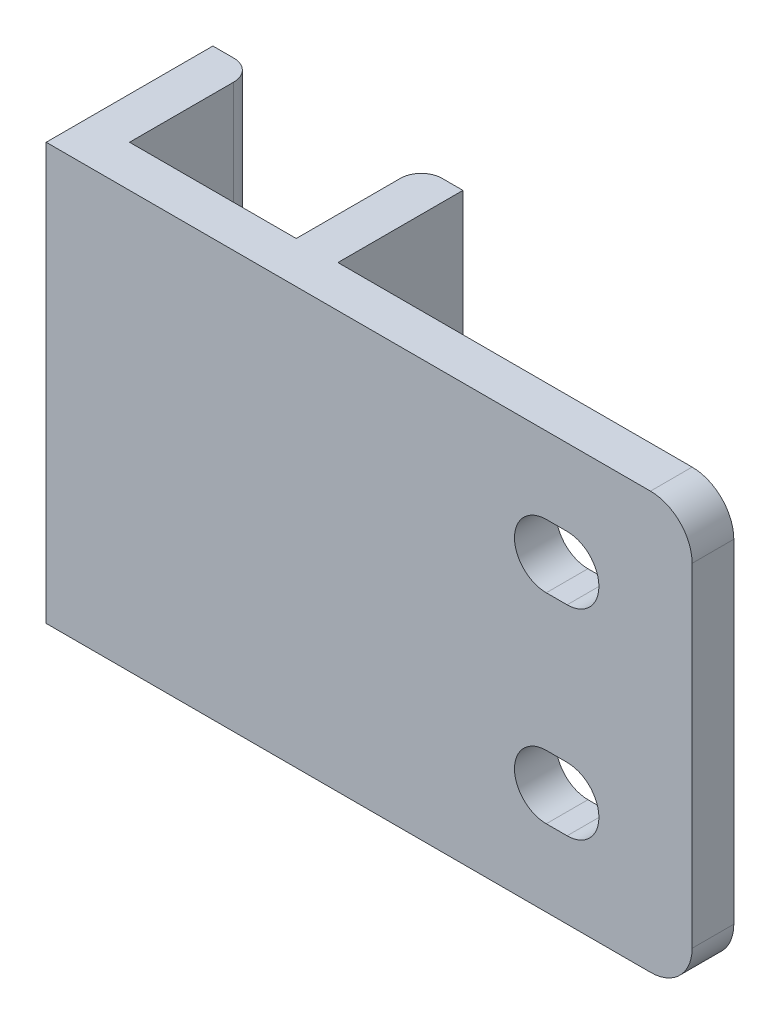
from build123d import *

# Parameters (mm, degrees)
ESQUISSE1_W        = 31
ESQUISSE1_H        = 20
BOSS_EXTRU_1_DEPTH = 2
ESQUISSE3_W        = 2
ESQUISSE3_H        = 20
BOSS_EXTRU_2_DEPTH = 6
CONG_1_R           = 1
CONG_2_R           = 2


with BuildPart() as part:
    # Esquisse1 → Boss.-Extru.1 (new body)
    with BuildSketch(Plane.XY):
        with Locations((-15, 0)):
            Rectangle(ESQUISSE1_W, ESQUISSE1_H)
        with BuildLine():
            Line((-6.5, -3.275), (-5.5, -3.275))
            ThreePointArc((-5.5, -3.275), (-3.975, -4.8), (-5.5, -6.325))
            Line((-5.5, -6.325), (-6.5, -6.325))
            ThreePointArc((-6.5, -6.325), (-8.025, -4.8), (-6.5, -3.275))
        make_face(mode=Mode.SUBTRACT)
        with BuildLine():
            Line((-6.5, 6.325), (-5.5, 6.325))
            ThreePointArc((-5.5, 6.325), (-3.975, 4.8), (-5.5, 3.275))
            Line((-5.5, 3.275), (-6.5, 3.275))
            ThreePointArc((-6.5, 3.275), (-8.025, 4.8), (-6.5, 6.325))
        make_face(mode=Mode.SUBTRACT)
    extrude(amount=BOSS_EXTRU_1_DEPTH)

    # Esquisse3 → Boss.-Extru.2 (add)
    with BuildSketch(Plane.XY):
        with Locations((-29.5, 0)):
            Rectangle(ESQUISSE3_W, ESQUISSE3_H)
        with Locations((-19.5, 0)):
            Rectangle(ESQUISSE3_W, ESQUISSE3_H)
    extrude(amount=-BOSS_EXTRU_2_DEPTH)

    # Cong_1
    cong_1_edges = [part.edges().sort_by_distance(p)[0] for p in [
        (-28.5, 0, -6),
        (-20.5, 0, -6),
    ]]
    fillet(cong_1_edges, radius=CONG_1_R)

    # Cong_2
    cong_2_edges = [part.edges().sort_by_distance(p)[0] for p in [
        (0.5, -10, 1),
        (0.5, 10, 1),
    ]]
    fillet(cong_2_edges, radius=CONG_2_R)


solid = part.part
